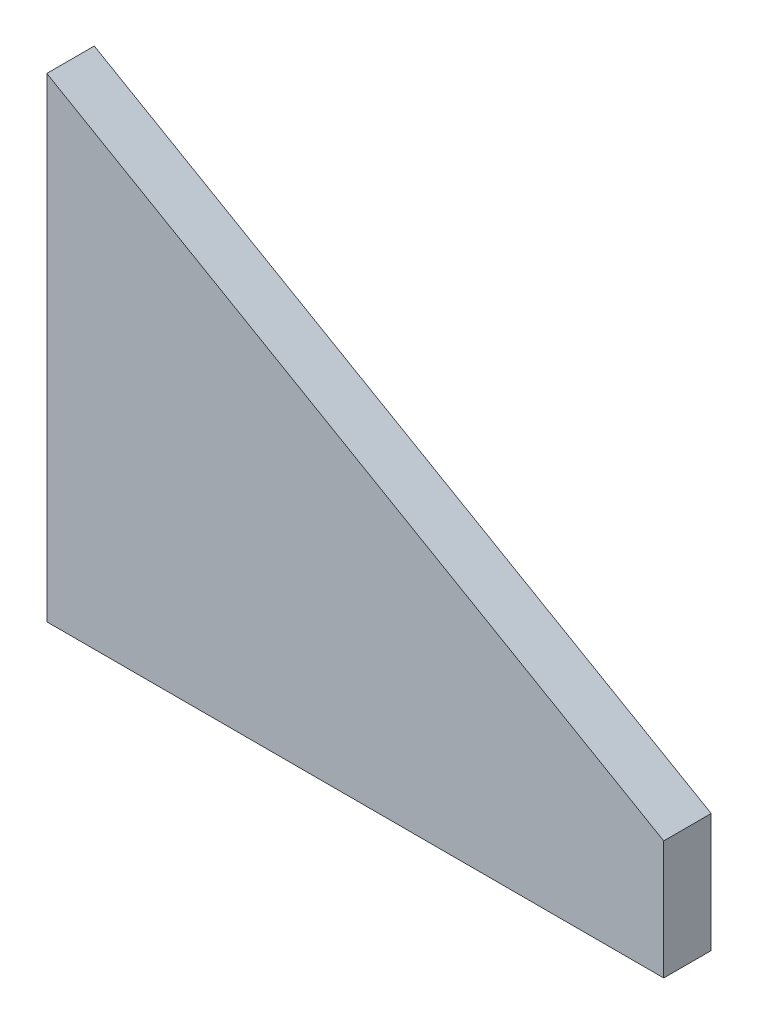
from build123d import *

# Parameters (mm, degrees)
AUFSATZ_LINEAR_AUSTRAGEN1_DEPTH = 20


with BuildPart() as part:
    # Skizze1 → Aufsatz-Linear austragen1 (new body)
    with BuildSketch(Plane.XY):
        Polygon((0, 0), (-259.807621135, 0), (-259.807621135, 200), (0, 50), align=None)
    extrude(amount=AUFSATZ_LINEAR_AUSTRAGEN1_DEPTH)


solid = part.part
